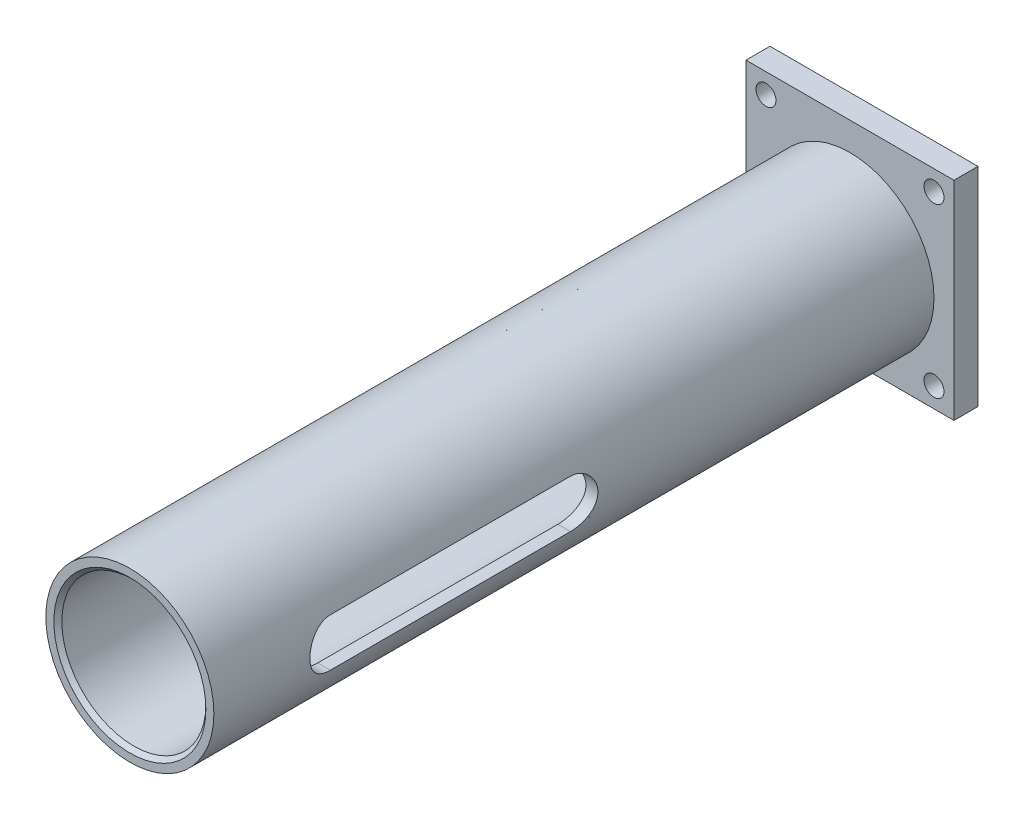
from build123d import *
from build123d.topology import SkipClean

# Parameters (mm, degrees)
SKETCH_1_W          = 26
SKETCH_1_H          = 26
SKETCH_1_R          = 1.5
SKETCH_1_R_2        = 9
EXTRUDE_1_DEPTH     = 3
EXTRUDE_START       = 2
SKETCH_2_R          = 11.15
SKETCH_2_R_2        = 9
EXTRUDE_2_DEPTH     = 2
SKETCH_3_R          = 10.5
SKETCH_3_R_2        = 9
EXTRUDE_3_DEPTH     = 90
FILLET_1_R          = 0.5
CUT_EXTRUDE_1_DEPTH = 15
CHAMFER_1_SIZE      = 0.5
EXTRUDE_START_2     = -3
SKETCH_5_R          = 1.5
SKETCH_5_R_2        = 1.25
EXTRUDE_4_DEPTH     = 3


with BuildPart() as part:
    # Sketch 1 → Extrude 1 (new body)
    with BuildSketch(Plane.XY):
        Rectangle(SKETCH_1_W, SKETCH_1_H)
        with Locations((-10.5, 10.5)):
            Circle(SKETCH_1_R, mode=Mode.SUBTRACT)
        with Locations((-10.5, -10.5)):
            Circle(SKETCH_1_R, mode=Mode.SUBTRACT)
        with Locations((10.5, 10.5)):
            Circle(SKETCH_1_R, mode=Mode.SUBTRACT)
        with Locations((10.5, -10.5)):
            Circle(SKETCH_1_R, mode=Mode.SUBTRACT)
        with Locations((0, -1)):
            Circle(SKETCH_1_R_2, mode=Mode.SUBTRACT)
    extrude(amount=EXTRUDE_1_DEPTH)

    # Sketch 2 → Extrude 2 (add)
    with SkipClean():  # the faces are left unmerged after this step: merging them gives an invalid solid
        with BuildSketch(Plane(origin=(0, 0, 0), x_dir=(-1, 0, 0), z_dir=(0, 0, -1)).offset(EXTRUDE_START)):
            with Locations(Location((0, -1, 0), (0, 0, 180))):
                Circle(SKETCH_2_R)
            with Locations((0, -1)):
                Circle(SKETCH_2_R_2, mode=Mode.SUBTRACT)
        extrude(amount=-EXTRUDE_2_DEPTH)

    # Sketch 3 → Extrude 3 (add)
    with BuildSketch(Plane.XY.offset(3)):
        with Locations(Location((0, -1, 0), (0, 0, 180))):
            Circle(SKETCH_3_R)
        with Locations(Location((0, -1, 0), (0, 0, 180))):
            Circle(SKETCH_3_R_2, mode=Mode.SUBTRACT)
    extrude(amount=EXTRUDE_3_DEPTH)

    # Fillet 1
    fillet_1_edges = [part.edges().sort_by_distance(p)[0] for p in [
        (-11.15, -1, -2),
    ]]
    fillet(fillet_1_edges, radius=FILLET_1_R)

    # Sketch 4 → Cut-Extrude 1 (cut, symmetric)
    with BuildSketch(Plane(origin=(0, 0, 0), x_dir=(0, 0, -1), z_dir=(1, 0, 0))):
        with BuildLine():
            Line((-78, 2), (-48, 2))
            ThreePointArc((-48, 2), (-45, -1), (-48, -4))
            Line((-48, -4), (-78, -4))
            ThreePointArc((-78, -4), (-81, -1), (-78, 2))
        make_face()
    extrude(amount=CUT_EXTRUDE_1_DEPTH, both=True, mode=Mode.SUBTRACT)

    # Chamfer 1
    chamfer_1_edges = [part.edges().sort_by_distance(p)[0] for p in [
        (9, -1, 93),
    ]]
    chamfer(chamfer_1_edges, length=CHAMFER_1_SIZE)

    # Sketch 5 → Extrude 4 (add)
    # profile 1 of 4: a face of its own
    with BuildSketch(Plane.XY.offset(3).offset(EXTRUDE_START_2)):
        with Locations((-10.5, -10.5)):
            Circle(SKETCH_5_R)
        with Locations((-10.5, -10.5)):
            Circle(SKETCH_5_R_2, mode=Mode.SUBTRACT)
    # profile 2 of 4: a face of its own
    with BuildSketch(Plane.XY.offset(3).offset(EXTRUDE_START_2)):
        with Locations((10.5, 10.5)):
            Circle(SKETCH_5_R)
        with Locations((10.5, 10.5)):
            Circle(SKETCH_5_R_2, mode=Mode.SUBTRACT)
    # profile 3 of 4: a face of its own
    with BuildSketch(Plane.XY.offset(3).offset(EXTRUDE_START_2)):
        with Locations((-10.5, 10.5)):
            Circle(SKETCH_5_R)
        with Locations((-10.5, 10.5)):
            Circle(SKETCH_5_R_2, mode=Mode.SUBTRACT)
    # profile 4 of 4: a face of its own
    with BuildSketch(Plane.XY.offset(3).offset(EXTRUDE_START_2)):
        with Locations((10.5, -10.5)):
            Circle(SKETCH_5_R)
        with Locations((10.5, -10.5)):
            Circle(SKETCH_5_R_2, mode=Mode.SUBTRACT)
    extrude(amount=EXTRUDE_4_DEPTH)


solid = part.part
